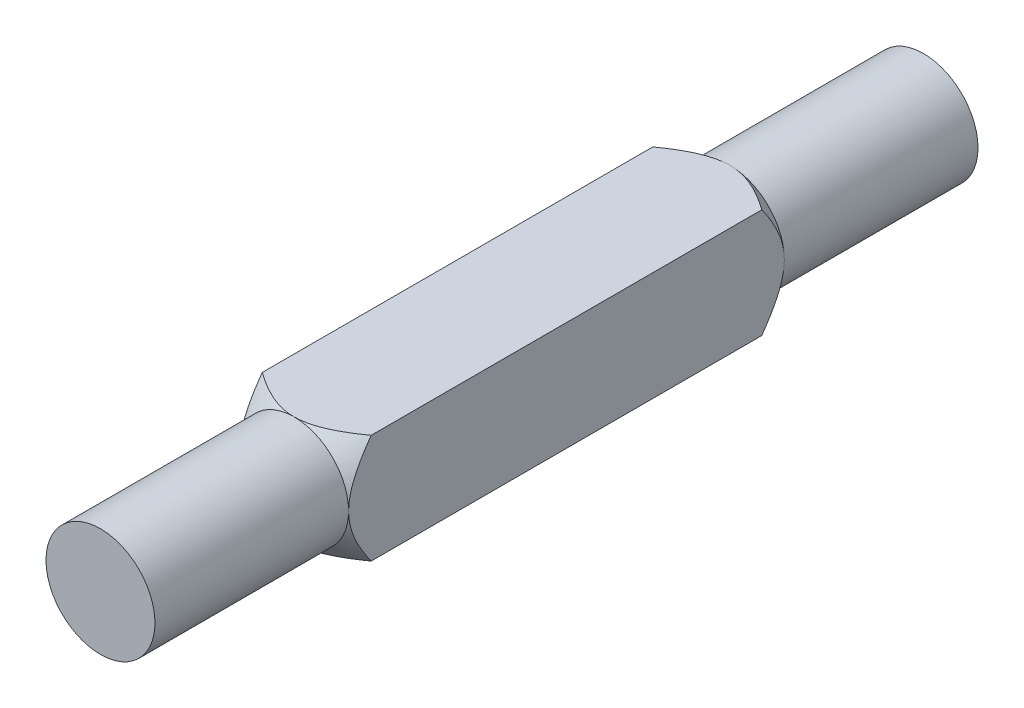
ISO-10303-21;
HEADER;
FILE_DESCRIPTION(('STEP AP214'),'2;1');
FILE_NAME('part.step','',(''),(''),'','','');
FILE_SCHEMA(('AUTOMOTIVE_DESIGN { 1 0 10303 214 1 1 1 1 }'));
ENDSEC;
DATA;
#1=APPLICATION_CONTEXT('core data for automotive mechanical design processes');
#2=APPLICATION_PROTOCOL_DEFINITION('international standard','automotive_design',2000,#1);
#3=PRODUCT_CONTEXT('',#1,'mechanical');
#4=PRODUCT('Part','Part','',(#3));
#5=PRODUCT_RELATED_PRODUCT_CATEGORY('part','',(#4));
#6=PRODUCT_DEFINITION_FORMATION('','',#4);
#7=PRODUCT_DEFINITION_CONTEXT('part definition',#1,'design');
#8=PRODUCT_DEFINITION('design','',#6,#7);
#9=PRODUCT_DEFINITION_SHAPE('','',#8);
#10=(LENGTH_UNIT() NAMED_UNIT(*) SI_UNIT(.MILLI.,.METRE.));
#11=(NAMED_UNIT(*) PLANE_ANGLE_UNIT() SI_UNIT($,.RADIAN.));
#12=(NAMED_UNIT(*) SI_UNIT($,.STERADIAN.) SOLID_ANGLE_UNIT());
#13=UNCERTAINTY_MEASURE_WITH_UNIT(LENGTH_MEASURE(1.E-05),#10,'distance_accuracy_value','');
#14=(GEOMETRIC_REPRESENTATION_CONTEXT(3) GLOBAL_UNCERTAINTY_ASSIGNED_CONTEXT((#13)) GLOBAL_UNIT_ASSIGNED_CONTEXT((#10,
#11,#12)) REPRESENTATION_CONTEXT('',''));
#15=CARTESIAN_POINT('',(0.,0.,0.));
#16=DIRECTION('',(0.,0.,1.));
#17=DIRECTION('',(1.,0.,0.));
#18=AXIS2_PLACEMENT_3D('',#15,#16,#17);
#19=CARTESIAN_POINT('',(-4.5,-4.5,34.));
#20=DIRECTION('',(1.,0.,0.));
#21=DIRECTION('',(0.,0.,-1.));
#22=AXIS2_PLACEMENT_3D('',#19,#20,#21);
#23=PLANE('',#22);
#24=DIRECTION('',(0.,0.,-1.));
#25=VECTOR('',#24,1.);
#26=CARTESIAN_POINT('',(-4.5,4.5,34.));
#27=LINE('',#26,#25);
#28=CARTESIAN_POINT('',(-4.5,4.5,16.1360389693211));
#29=VERTEX_POINT('',#28);
#30=CARTESIAN_POINT('',(-4.5,4.5,-16.1360389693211));
#31=VERTEX_POINT('',#30);
#32=EDGE_CURVE('E131',#29,#31,#27,.T.);
#33=ORIENTED_EDGE('',*,*,#32,.T.);
#34=CARTESIAN_POINT('',(-4.5,-8.68330802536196,-12.7199264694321));
#35=CARTESIAN_POINT('',(-4.5,-8.48158104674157,-12.8990024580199));
#36=CARTESIAN_POINT('',(-4.5,-8.27922210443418,-13.0773734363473));
#37=CARTESIAN_POINT('',(-4.5,-7.87290355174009,-13.4323274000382));
#38=CARTESIAN_POINT('',(-4.5,-7.66894376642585,-13.6089101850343));
#39=CARTESIAN_POINT('',(-4.5,-7.25820360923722,-13.9606644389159));
#40=CARTESIAN_POINT('',(-4.5,-7.05141464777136,-14.1358258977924));
#41=CARTESIAN_POINT('',(-4.5,-6.63550363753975,-14.4833398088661));
#42=CARTESIAN_POINT('',(-4.5,-6.42638170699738,-14.6556924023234));
#43=CARTESIAN_POINT('',(-4.5,-5.99276434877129,-15.0069306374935));
#44=CARTESIAN_POINT('',(-4.5,-5.76809196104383,-15.1855986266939));
#45=CARTESIAN_POINT('',(-4.5,-5.31462777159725,-15.5376133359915));
#46=CARTESIAN_POINT('',(-4.5,-5.08583624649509,-15.7109604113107));
#47=CARTESIAN_POINT('',(-4.5,-4.6233432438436,-16.0501511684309));
#48=CARTESIAN_POINT('',(-4.5,-4.38965142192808,-16.2160078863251));
#49=CARTESIAN_POINT('',(-4.5,-4.03400015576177,-16.4571840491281));
#50=CARTESIAN_POINT('',(-4.5,-3.91461429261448,-16.5362975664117));
#51=CARTESIAN_POINT('',(-4.5,-3.67388199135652,-16.691477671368));
#52=CARTESIAN_POINT('',(-4.5,-3.55253563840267,-16.7675443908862));
#53=CARTESIAN_POINT('',(-4.5,-3.26113140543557,-16.9442017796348));
#54=CARTESIAN_POINT('',(-4.5,-3.09006447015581,-17.043143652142));
#55=CARTESIAN_POINT('',(-4.5,-2.74288321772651,-17.2319657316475));
#56=CARTESIAN_POINT('',(-4.5,-2.56676738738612,-17.3218431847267));
#57=CARTESIAN_POINT('',(-4.5,-2.21034319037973,-17.4889083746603));
#58=CARTESIAN_POINT('',(-4.5,-2.03008217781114,-17.5661959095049));
#59=CARTESIAN_POINT('',(-4.5,-1.66366713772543,-17.7053004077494));
#60=CARTESIAN_POINT('',(-4.5,-1.47751679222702,-17.767126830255));
#61=CARTESIAN_POINT('',(-4.5,-1.15792868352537,-17.8551096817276));
#62=CARTESIAN_POINT('',(-4.5,-1.02590368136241,-17.8863877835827));
#63=CARTESIAN_POINT('',(-4.5,-0.759746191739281,-17.9381805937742));
#64=CARTESIAN_POINT('',(-4.5,-0.625614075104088,-17.9586971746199));
#65=CARTESIAN_POINT('',(-4.5,-0.356412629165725,-17.9878848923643));
#66=CARTESIAN_POINT('',(-4.5,-0.221346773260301,-17.9965876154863));
#67=CARTESIAN_POINT('',(-4.5,0.0490257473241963,-18.0017628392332));
#68=CARTESIAN_POINT('',(-4.5,0.1843324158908,-17.9982351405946));
#69=CARTESIAN_POINT('',(-4.5,0.453784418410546,-17.9791713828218));
#70=CARTESIAN_POINT('',(-4.5,0.587931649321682,-17.9636616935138));
#71=CARTESIAN_POINT('',(-4.5,0.854467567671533,-17.9214869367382));
#72=CARTESIAN_POINT('',(-4.5,0.986855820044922,-17.8948191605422));
#73=CARTESIAN_POINT('',(-4.5,1.24969278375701,-17.8314464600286));
#74=CARTESIAN_POINT('',(-4.5,1.38013256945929,-17.7947049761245));
#75=CARTESIAN_POINT('',(-4.5,1.63824648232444,-17.7126340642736));
#76=CARTESIAN_POINT('',(-4.5,1.76592063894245,-17.6673047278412));
#77=CARTESIAN_POINT('',(-4.5,2.05959775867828,-17.553475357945));
#78=CARTESIAN_POINT('',(-4.5,2.22453500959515,-17.4822379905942));
#79=CARTESIAN_POINT('',(-4.5,2.54978336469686,-17.329822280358));
#80=CARTESIAN_POINT('',(-4.5,2.71009203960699,-17.248638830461));
#81=CARTESIAN_POINT('',(-4.5,3.02684536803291,-17.0783835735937));
#82=CARTESIAN_POINT('',(-4.5,3.18328165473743,-16.9892963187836));
#83=CARTESIAN_POINT('',(-4.5,3.49249529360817,-16.8050801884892));
#84=CARTESIAN_POINT('',(-4.5,3.64527325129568,-16.709952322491));
#85=CARTESIAN_POINT('',(-4.5,3.94991460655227,-16.5135084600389));
#86=CARTESIAN_POINT('',(-4.5,4.10173298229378,-16.4121229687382));
#87=CARTESIAN_POINT('',(-4.5,4.40267413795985,-16.2054321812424));
#88=CARTESIAN_POINT('',(-4.5,4.55179683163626,-16.1001267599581));
#89=CARTESIAN_POINT('',(-4.5,4.847572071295,-15.8864902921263));
#90=CARTESIAN_POINT('',(-4.5,4.99422744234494,-15.7781631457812));
#91=CARTESIAN_POINT('',(-4.5,5.28559307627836,-15.5589414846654));
#92=CARTESIAN_POINT('',(-4.5,5.43030341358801,-15.4480470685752));
#93=CARTESIAN_POINT('',(-4.5,5.75227816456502,-15.1975228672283));
#94=CARTESIAN_POINT('',(-4.5,5.92910326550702,-15.0573290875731));
#95=CARTESIAN_POINT('',(-4.5,6.28066027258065,-14.7743379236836));
#96=CARTESIAN_POINT('',(-4.5,6.45539211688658,-14.6315404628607));
#97=CARTESIAN_POINT('',(-4.5,6.97702291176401,-14.1999709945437));
#98=CARTESIAN_POINT('',(-4.5,7.32131793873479,-13.9080527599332));
#99=CARTESIAN_POINT('',(-4.5,8.00510557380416,-13.31839222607));
#100=CARTESIAN_POINT('',(-4.5,8.3445961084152,-13.0206475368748));
#101=CARTESIAN_POINT('',(-4.5,9.01993957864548,-12.4210524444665));
#102=CARTESIAN_POINT('',(-4.5,9.355792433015,-12.119201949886));
#103=CARTESIAN_POINT('',(-4.5,10.0254208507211,-11.5118619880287));
#104=CARTESIAN_POINT('',(-4.5,10.3591908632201,-11.2063664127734));
#105=CARTESIAN_POINT('',(-4.5,11.0246028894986,-10.5930595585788));
#106=CARTESIAN_POINT('',(-4.5,11.356244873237,-10.2852482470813));
#107=CARTESIAN_POINT('',(-4.5,12.0177625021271,-9.66791121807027));
#108=CARTESIAN_POINT('',(-4.5,12.3476385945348,-9.35838597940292));
#109=CARTESIAN_POINT('',(-4.5,13.0060463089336,-8.7379091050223));
#110=CARTESIAN_POINT('',(-4.5,13.334577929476,-8.42695746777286));
#111=CARTESIAN_POINT('',(-4.5,14.2385387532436,-7.56837718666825));
#112=CARTESIAN_POINT('',(-4.5,14.8128367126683,-7.01955775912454));
#113=CARTESIAN_POINT('',(-4.5,15.9590864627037,-5.9193871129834));
#114=CARTESIAN_POINT('',(-4.5,16.531038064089,-5.36803569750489));
#115=CARTESIAN_POINT('',(-4.5,17.6712329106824,-4.26537922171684));
#116=CARTESIAN_POINT('',(-4.5,18.2394821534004,-3.71408035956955));
#117=CARTESIAN_POINT('',(-4.5,19.374567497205,-2.61012965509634));
#118=CARTESIAN_POINT('',(-4.5,19.941403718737,-2.05747793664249));
#119=CARTESIAN_POINT('',(-4.5,20.5077557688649,-1.50433266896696));
#120=B_SPLINE_CURVE_WITH_KNOTS('',3,(#34,#35,#36,#37,#38,#39,#40,#41,#42,#43,#44,#45,#46,#47,
#48,#49,#50,#51,#52,#53,#54,#55,#56,#57,#58,#59,#60,#61,#62,#63,#64,#65,#66,#67,#68,#69,#70,#71,
#72,#73,#74,#75,#76,#77,#78,#79,#80,#81,#82,#83,#84,#85,#86,#87,#88,#89,#90,#91,#92,#93,#94,#95,
#96,#97,#98,#99,#100,#101,#102,#103,#104,#105,#106,#107,#108,#109,#110,#111,#112,#113,#114,#115,
#116,#117,#118,#119),.UNSPECIFIED.,.F.,.F.,(4,2,2,2,2,2,2,2,2,2,2,2,2,2,2,2,2,2,2,2,2,2,2,2,2,2,
2,2,2,2,2,2,2,2,2,2,2,2,2,2,2,2,4),(0.,0.809238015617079,1.618565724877,2.43155783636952,
3.24450893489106,4.10560871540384,4.96665088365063,5.82613170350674,6.25575364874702,
6.6853569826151,7.27800108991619,7.87082471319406,8.4586926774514,9.04620009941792,
9.45285703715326,9.85944319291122,10.264940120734,10.670443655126,11.0750572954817,
11.4797692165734,11.8859698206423,12.2921660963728,12.8307118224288,13.3695352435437,
13.9094360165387,14.4492467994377,14.9968483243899,15.5444673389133,16.0914095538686,
16.6383307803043,17.3152717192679,17.9922326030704,19.3463039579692,20.7009428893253,
22.0556120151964,23.4130113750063,24.7704298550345,26.1274865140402,27.4845446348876,
29.8676373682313,32.2509186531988,34.6261082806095,37.0010880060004),.UNSPECIFIED.);
#121=CARTESIAN_POINT('',(-4.5,0.,-18.));
#122=VERTEX_POINT('',#121);
#123=EDGE_CURVE('E53',#31,#122,#120,.F.);
#124=ORIENTED_EDGE('',*,*,#123,.T.);
#125=CARTESIAN_POINT('',(-4.5,-4.5,-16.1360389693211));
#126=VERTEX_POINT('',#125);
#127=EDGE_CURVE('E105',#122,#126,#120,.F.);
#128=ORIENTED_EDGE('',*,*,#127,.T.);
#129=DIRECTION('',(0.,0.,-1.));
#130=VECTOR('',#129,1.);
#131=CARTESIAN_POINT('',(-4.5,-4.5,34.));
#132=LINE('',#131,#130);
#133=CARTESIAN_POINT('',(-4.5,-4.5,16.1360389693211));
#134=VERTEX_POINT('',#133);
#135=EDGE_CURVE('E214',#134,#126,#132,.T.);
#136=ORIENTED_EDGE('',*,*,#135,.F.);
#137=CARTESIAN_POINT('',(-4.5,-8.68330802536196,12.7199264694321));
#138=CARTESIAN_POINT('',(-4.5,-8.48158104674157,12.8990024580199));
#139=CARTESIAN_POINT('',(-4.5,-8.27922210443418,13.0773734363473));
#140=CARTESIAN_POINT('',(-4.5,-7.87290355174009,13.4323274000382));
#141=CARTESIAN_POINT('',(-4.5,-7.66894376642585,13.6089101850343));
#142=CARTESIAN_POINT('',(-4.5,-7.25820360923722,13.9606644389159));
#143=CARTESIAN_POINT('',(-4.5,-7.05141464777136,14.1358258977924));
#144=CARTESIAN_POINT('',(-4.5,-6.63550363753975,14.4833398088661));
#145=CARTESIAN_POINT('',(-4.5,-6.42638170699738,14.6556924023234));
#146=CARTESIAN_POINT('',(-4.5,-5.99276434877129,15.0069306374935));
#147=CARTESIAN_POINT('',(-4.5,-5.76809196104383,15.1855986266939));
#148=CARTESIAN_POINT('',(-4.5,-5.31462777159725,15.5376133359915));
#149=CARTESIAN_POINT('',(-4.5,-5.08583624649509,15.7109604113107));
#150=CARTESIAN_POINT('',(-4.5,-4.6233432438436,16.0501511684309));
#151=CARTESIAN_POINT('',(-4.5,-4.38965142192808,16.2160078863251));
#152=CARTESIAN_POINT('',(-4.5,-4.03400015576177,16.4571840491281));
#153=CARTESIAN_POINT('',(-4.5,-3.91461429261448,16.5362975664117));
#154=CARTESIAN_POINT('',(-4.5,-3.67388199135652,16.691477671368));
#155=CARTESIAN_POINT('',(-4.5,-3.55253563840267,16.7675443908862));
#156=CARTESIAN_POINT('',(-4.5,-3.26113140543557,16.9442017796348));
#157=CARTESIAN_POINT('',(-4.5,-3.09006447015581,17.043143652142));
#158=CARTESIAN_POINT('',(-4.5,-2.74288321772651,17.2319657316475));
#159=CARTESIAN_POINT('',(-4.5,-2.56676738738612,17.3218431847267));
#160=CARTESIAN_POINT('',(-4.5,-2.21034319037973,17.4889083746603));
#161=CARTESIAN_POINT('',(-4.5,-2.03008217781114,17.5661959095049));
#162=CARTESIAN_POINT('',(-4.5,-1.66366713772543,17.7053004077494));
#163=CARTESIAN_POINT('',(-4.5,-1.47751679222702,17.767126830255));
#164=CARTESIAN_POINT('',(-4.5,-1.15792868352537,17.8551096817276));
#165=CARTESIAN_POINT('',(-4.5,-1.02590368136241,17.8863877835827));
#166=CARTESIAN_POINT('',(-4.5,-0.759746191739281,17.9381805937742));
#167=CARTESIAN_POINT('',(-4.5,-0.625614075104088,17.9586971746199));
#168=CARTESIAN_POINT('',(-4.5,-0.356412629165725,17.9878848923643));
#169=CARTESIAN_POINT('',(-4.5,-0.221346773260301,17.9965876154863));
#170=CARTESIAN_POINT('',(-4.5,0.0490257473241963,18.0017628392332));
#171=CARTESIAN_POINT('',(-4.5,0.1843324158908,17.9982351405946));
#172=CARTESIAN_POINT('',(-4.5,0.453784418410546,17.9791713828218));
#173=CARTESIAN_POINT('',(-4.5,0.587931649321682,17.9636616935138));
#174=CARTESIAN_POINT('',(-4.5,0.854467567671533,17.9214869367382));
#175=CARTESIAN_POINT('',(-4.5,0.986855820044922,17.8948191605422));
#176=CARTESIAN_POINT('',(-4.5,1.24969278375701,17.8314464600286));
#177=CARTESIAN_POINT('',(-4.5,1.38013256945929,17.7947049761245));
#178=CARTESIAN_POINT('',(-4.5,1.63824648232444,17.7126340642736));
#179=CARTESIAN_POINT('',(-4.5,1.76592063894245,17.6673047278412));
#180=CARTESIAN_POINT('',(-4.5,2.05959775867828,17.553475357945));
#181=CARTESIAN_POINT('',(-4.5,2.22453500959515,17.4822379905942));
#182=CARTESIAN_POINT('',(-4.5,2.54978336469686,17.329822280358));
#183=CARTESIAN_POINT('',(-4.5,2.71009203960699,17.248638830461));
#184=CARTESIAN_POINT('',(-4.5,3.02684536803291,17.0783835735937));
#185=CARTESIAN_POINT('',(-4.5,3.18328165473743,16.9892963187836));
#186=CARTESIAN_POINT('',(-4.5,3.49249529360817,16.8050801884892));
#187=CARTESIAN_POINT('',(-4.5,3.64527325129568,16.709952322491));
#188=CARTESIAN_POINT('',(-4.5,3.94991460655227,16.5135084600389));
#189=CARTESIAN_POINT('',(-4.5,4.10173298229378,16.4121229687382));
#190=CARTESIAN_POINT('',(-4.5,4.40267413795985,16.2054321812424));
#191=CARTESIAN_POINT('',(-4.5,4.55179683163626,16.1001267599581));
#192=CARTESIAN_POINT('',(-4.5,4.847572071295,15.8864902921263));
#193=CARTESIAN_POINT('',(-4.5,4.99422744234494,15.7781631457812));
#194=CARTESIAN_POINT('',(-4.5,5.28559307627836,15.5589414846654));
#195=CARTESIAN_POINT('',(-4.5,5.43030341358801,15.4480470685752));
#196=CARTESIAN_POINT('',(-4.5,5.75227816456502,15.1975228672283));
#197=CARTESIAN_POINT('',(-4.5,5.92910326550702,15.0573290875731));
#198=CARTESIAN_POINT('',(-4.5,6.28066027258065,14.7743379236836));
#199=CARTESIAN_POINT('',(-4.5,6.45539211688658,14.6315404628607));
#200=CARTESIAN_POINT('',(-4.5,6.97702291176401,14.1999709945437));
#201=CARTESIAN_POINT('',(-4.5,7.32131793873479,13.9080527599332));
#202=CARTESIAN_POINT('',(-4.5,8.00510557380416,13.31839222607));
#203=CARTESIAN_POINT('',(-4.5,8.3445961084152,13.0206475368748));
#204=CARTESIAN_POINT('',(-4.5,9.01993957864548,12.4210524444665));
#205=CARTESIAN_POINT('',(-4.5,9.355792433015,12.119201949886));
#206=CARTESIAN_POINT('',(-4.5,10.0254208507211,11.5118619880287));
#207=CARTESIAN_POINT('',(-4.5,10.3591908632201,11.2063664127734));
#208=CARTESIAN_POINT('',(-4.5,11.0246028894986,10.5930595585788));
#209=CARTESIAN_POINT('',(-4.5,11.356244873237,10.2852482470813));
#210=CARTESIAN_POINT('',(-4.5,12.0177625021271,9.66791121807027));
#211=CARTESIAN_POINT('',(-4.5,12.3476385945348,9.35838597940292));
#212=CARTESIAN_POINT('',(-4.5,13.0060463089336,8.7379091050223));
#213=CARTESIAN_POINT('',(-4.5,13.334577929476,8.42695746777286));
#214=CARTESIAN_POINT('',(-4.5,14.2385387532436,7.56837718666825));
#215=CARTESIAN_POINT('',(-4.5,14.8128367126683,7.01955775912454));
#216=CARTESIAN_POINT('',(-4.5,15.9590864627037,5.9193871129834));
#217=CARTESIAN_POINT('',(-4.5,16.531038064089,5.36803569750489));
#218=CARTESIAN_POINT('',(-4.5,17.6712329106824,4.26537922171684));
#219=CARTESIAN_POINT('',(-4.5,18.2394821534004,3.71408035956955));
#220=CARTESIAN_POINT('',(-4.5,19.374567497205,2.61012965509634));
#221=CARTESIAN_POINT('',(-4.5,19.941403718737,2.05747793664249));
#222=CARTESIAN_POINT('',(-4.5,20.5077557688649,1.50433266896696));
#223=B_SPLINE_CURVE_WITH_KNOTS('',3,(#137,#138,#139,#140,#141,#142,#143,#144,#145,#146,#147,
#148,#149,#150,#151,#152,#153,#154,#155,#156,#157,#158,#159,#160,#161,#162,#163,#164,#165,#166,
#167,#168,#169,#170,#171,#172,#173,#174,#175,#176,#177,#178,#179,#180,#181,#182,#183,#184,#185,
#186,#187,#188,#189,#190,#191,#192,#193,#194,#195,#196,#197,#198,#199,#200,#201,#202,#203,#204,
#205,#206,#207,#208,#209,#210,#211,#212,#213,#214,#215,#216,#217,#218,#219,#220,#221,#222),
.UNSPECIFIED.,.F.,.F.,(4,2,2,2,2,2,2,2,2,2,2,2,2,2,2,2,2,2,2,2,2,2,2,2,2,2,2,2,2,2,2,2,2,2,2,2,
2,2,2,2,2,2,4),(0.,0.809238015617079,1.618565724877,2.43155783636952,3.24450893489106,
4.10560871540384,4.96665088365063,5.82613170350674,6.25575364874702,6.6853569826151,
7.27800108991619,7.87082471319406,8.4586926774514,9.04620009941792,9.45285703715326,
9.85944319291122,10.264940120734,10.670443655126,11.0750572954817,11.4797692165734,
11.8859698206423,12.2921660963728,12.8307118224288,13.3695352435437,13.9094360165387,
14.4492467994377,14.9968483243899,15.5444673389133,16.0914095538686,16.6383307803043,
17.3152717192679,17.9922326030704,19.3463039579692,20.7009428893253,22.0556120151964,
23.4130113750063,24.7704298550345,26.1274865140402,27.4845446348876,29.8676373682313,
32.2509186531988,34.6261082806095,37.0010880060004),.UNSPECIFIED.);
#224=CARTESIAN_POINT('',(-4.5,0.,18.));
#225=VERTEX_POINT('',#224);
#226=EDGE_CURVE('E236',#134,#225,#223,.T.);
#227=ORIENTED_EDGE('',*,*,#226,.T.);
#228=EDGE_CURVE('E176',#225,#29,#223,.T.);
#229=ORIENTED_EDGE('',*,*,#228,.T.);
#230=EDGE_LOOP('',(#33,#124,#128,#136,#227,#229));
#231=FACE_BOUND('',#230,.T.);
#232=ADVANCED_FACE('F33',(#231),#23,.F.);
#233=CARTESIAN_POINT('',(-4.5,-4.5,34.));
#234=DIRECTION('',(0.,1.,0.));
#235=DIRECTION('',(0.,0.,1.));
#236=AXIS2_PLACEMENT_3D('',#233,#234,#235);
#237=PLANE('',#236);
#238=ORIENTED_EDGE('',*,*,#135,.T.);
#239=CARTESIAN_POINT('',(-8.68330802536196,-4.5,-12.7199264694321));
#240=CARTESIAN_POINT('',(-8.48158104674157,-4.5,-12.8990024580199));
#241=CARTESIAN_POINT('',(-8.27922210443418,-4.5,-13.0773734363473));
#242=CARTESIAN_POINT('',(-7.87290355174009,-4.5,-13.4323274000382));
#243=CARTESIAN_POINT('',(-7.66894376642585,-4.5,-13.6089101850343));
#244=CARTESIAN_POINT('',(-7.25820360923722,-4.5,-13.9606644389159));
#245=CARTESIAN_POINT('',(-7.05141464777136,-4.5,-14.1358258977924));
#246=CARTESIAN_POINT('',(-6.63550363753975,-4.5,-14.4833398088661));
#247=CARTESIAN_POINT('',(-6.42638170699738,-4.5,-14.6556924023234));
#248=CARTESIAN_POINT('',(-5.99276434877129,-4.5,-15.0069306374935));
#249=CARTESIAN_POINT('',(-5.76809196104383,-4.5,-15.1855986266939));
#250=CARTESIAN_POINT('',(-5.31462777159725,-4.5,-15.5376133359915));
#251=CARTESIAN_POINT('',(-5.08583624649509,-4.5,-15.7109604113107));
#252=CARTESIAN_POINT('',(-4.6233432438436,-4.5,-16.0501511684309));
#253=CARTESIAN_POINT('',(-4.38965142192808,-4.5,-16.2160078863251));
#254=CARTESIAN_POINT('',(-4.03400015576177,-4.5,-16.4571840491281));
#255=CARTESIAN_POINT('',(-3.91461429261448,-4.5,-16.5362975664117));
#256=CARTESIAN_POINT('',(-3.67388199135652,-4.5,-16.691477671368));
#257=CARTESIAN_POINT('',(-3.55253563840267,-4.5,-16.7675443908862));
#258=CARTESIAN_POINT('',(-3.26113140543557,-4.5,-16.9442017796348));
#259=CARTESIAN_POINT('',(-3.09006447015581,-4.5,-17.043143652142));
#260=CARTESIAN_POINT('',(-2.74288321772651,-4.5,-17.2319657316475));
#261=CARTESIAN_POINT('',(-2.56676738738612,-4.5,-17.3218431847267));
#262=CARTESIAN_POINT('',(-2.21034319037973,-4.5,-17.4889083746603));
#263=CARTESIAN_POINT('',(-2.03008217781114,-4.5,-17.5661959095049));
#264=CARTESIAN_POINT('',(-1.66366713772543,-4.5,-17.7053004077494));
#265=CARTESIAN_POINT('',(-1.47751679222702,-4.5,-17.767126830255));
#266=CARTESIAN_POINT('',(-1.15792868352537,-4.5,-17.8551096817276));
#267=CARTESIAN_POINT('',(-1.02590368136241,-4.5,-17.8863877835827));
#268=CARTESIAN_POINT('',(-0.759746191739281,-4.5,-17.9381805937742));
#269=CARTESIAN_POINT('',(-0.625614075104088,-4.5,-17.9586971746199));
#270=CARTESIAN_POINT('',(-0.356412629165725,-4.5,-17.9878848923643));
#271=CARTESIAN_POINT('',(-0.221346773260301,-4.5,-17.9965876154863));
#272=CARTESIAN_POINT('',(0.0490257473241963,-4.5,-18.0017628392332));
#273=CARTESIAN_POINT('',(0.1843324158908,-4.5,-17.9982351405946));
#274=CARTESIAN_POINT('',(0.453784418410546,-4.5,-17.9791713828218));
#275=CARTESIAN_POINT('',(0.587931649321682,-4.5,-17.9636616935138));
#276=CARTESIAN_POINT('',(0.854467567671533,-4.5,-17.9214869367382));
#277=CARTESIAN_POINT('',(0.986855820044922,-4.5,-17.8948191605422));
#278=CARTESIAN_POINT('',(1.24969278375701,-4.5,-17.8314464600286));
#279=CARTESIAN_POINT('',(1.38013256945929,-4.5,-17.7947049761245));
#280=CARTESIAN_POINT('',(1.63824648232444,-4.5,-17.7126340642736));
#281=CARTESIAN_POINT('',(1.76592063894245,-4.5,-17.6673047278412));
#282=CARTESIAN_POINT('',(2.05959775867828,-4.5,-17.553475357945));
#283=CARTESIAN_POINT('',(2.22453500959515,-4.5,-17.4822379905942));
#284=CARTESIAN_POINT('',(2.54978336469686,-4.5,-17.329822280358));
#285=CARTESIAN_POINT('',(2.71009203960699,-4.5,-17.248638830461));
#286=CARTESIAN_POINT('',(3.02684536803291,-4.5,-17.0783835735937));
#287=CARTESIAN_POINT('',(3.18328165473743,-4.5,-16.9892963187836));
#288=CARTESIAN_POINT('',(3.49249529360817,-4.5,-16.8050801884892));
#289=CARTESIAN_POINT('',(3.64527325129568,-4.5,-16.709952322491));
#290=CARTESIAN_POINT('',(3.94991460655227,-4.5,-16.5135084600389));
#291=CARTESIAN_POINT('',(4.10173298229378,-4.5,-16.4121229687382));
#292=CARTESIAN_POINT('',(4.40267413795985,-4.5,-16.2054321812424));
#293=CARTESIAN_POINT('',(4.55179683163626,-4.5,-16.1001267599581));
#294=CARTESIAN_POINT('',(4.847572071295,-4.5,-15.8864902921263));
#295=CARTESIAN_POINT('',(4.99422744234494,-4.5,-15.7781631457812));
#296=CARTESIAN_POINT('',(5.28559307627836,-4.5,-15.5589414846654));
#297=CARTESIAN_POINT('',(5.43030341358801,-4.5,-15.4480470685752));
#298=CARTESIAN_POINT('',(5.75227816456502,-4.5,-15.1975228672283));
#299=CARTESIAN_POINT('',(5.92910326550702,-4.5,-15.0573290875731));
#300=CARTESIAN_POINT('',(6.28066027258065,-4.5,-14.7743379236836));
#301=CARTESIAN_POINT('',(6.45539211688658,-4.5,-14.6315404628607));
#302=CARTESIAN_POINT('',(6.97702291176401,-4.5,-14.1999709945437));
#303=CARTESIAN_POINT('',(7.32131793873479,-4.5,-13.9080527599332));
#304=CARTESIAN_POINT('',(8.00510557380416,-4.5,-13.31839222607));
#305=CARTESIAN_POINT('',(8.3445961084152,-4.5,-13.0206475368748));
#306=CARTESIAN_POINT('',(9.01993957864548,-4.5,-12.4210524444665));
#307=CARTESIAN_POINT('',(9.355792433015,-4.5,-12.119201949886));
#308=CARTESIAN_POINT('',(10.0254208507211,-4.5,-11.5118619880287));
#309=CARTESIAN_POINT('',(10.3591908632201,-4.5,-11.2063664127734));
#310=CARTESIAN_POINT('',(11.0246028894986,-4.5,-10.5930595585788));
#311=CARTESIAN_POINT('',(11.356244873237,-4.5,-10.2852482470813));
#312=CARTESIAN_POINT('',(12.0177625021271,-4.5,-9.66791121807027));
#313=CARTESIAN_POINT('',(12.3476385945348,-4.5,-9.35838597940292));
#314=CARTESIAN_POINT('',(13.0060463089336,-4.5,-8.7379091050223));
#315=CARTESIAN_POINT('',(13.334577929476,-4.5,-8.42695746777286));
#316=CARTESIAN_POINT('',(14.2385387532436,-4.5,-7.56837718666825));
#317=CARTESIAN_POINT('',(14.8128367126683,-4.5,-7.01955775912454));
#318=CARTESIAN_POINT('',(15.9590864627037,-4.5,-5.9193871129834));
#319=CARTESIAN_POINT('',(16.531038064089,-4.5,-5.36803569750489));
#320=CARTESIAN_POINT('',(17.6712329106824,-4.5,-4.26537922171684));
#321=CARTESIAN_POINT('',(18.2394821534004,-4.5,-3.71408035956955));
#322=CARTESIAN_POINT('',(19.374567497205,-4.5,-2.61012965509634));
#323=CARTESIAN_POINT('',(19.941403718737,-4.5,-2.05747793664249));
#324=CARTESIAN_POINT('',(20.5077557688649,-4.5,-1.50433266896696));
#325=B_SPLINE_CURVE_WITH_KNOTS('',3,(#239,#240,#241,#242,#243,#244,#245,#246,#247,#248,#249,
#250,#251,#252,#253,#254,#255,#256,#257,#258,#259,#260,#261,#262,#263,#264,#265,#266,#267,#268,
#269,#270,#271,#272,#273,#274,#275,#276,#277,#278,#279,#280,#281,#282,#283,#284,#285,#286,#287,
#288,#289,#290,#291,#292,#293,#294,#295,#296,#297,#298,#299,#300,#301,#302,#303,#304,#305,#306,
#307,#308,#309,#310,#311,#312,#313,#314,#315,#316,#317,#318,#319,#320,#321,#322,#323,#324),
.UNSPECIFIED.,.F.,.F.,(4,2,2,2,2,2,2,2,2,2,2,2,2,2,2,2,2,2,2,2,2,2,2,2,2,2,2,2,2,2,2,2,2,2,2,2,
2,2,2,2,2,2,4),(0.,0.809238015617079,1.618565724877,2.43155783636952,3.24450893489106,
4.10560871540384,4.96665088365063,5.82613170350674,6.25575364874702,6.6853569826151,
7.27800108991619,7.87082471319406,8.4586926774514,9.04620009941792,9.45285703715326,
9.85944319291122,10.264940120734,10.670443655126,11.0750572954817,11.4797692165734,
11.8859698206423,12.2921660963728,12.8307118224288,13.3695352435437,13.9094360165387,
14.4492467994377,14.9968483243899,15.5444673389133,16.0914095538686,16.6383307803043,
17.3152717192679,17.9922326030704,19.3463039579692,20.7009428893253,22.0556120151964,
23.4130113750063,24.7704298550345,26.1274865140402,27.4845446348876,29.8676373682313,
32.2509186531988,34.6261082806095,37.0010880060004),.UNSPECIFIED.);
#326=CARTESIAN_POINT('',(0.,-4.5,-18.));
#327=VERTEX_POINT('',#326);
#328=EDGE_CURVE('E111',#126,#327,#325,.T.);
#329=ORIENTED_EDGE('',*,*,#328,.T.);
#330=CARTESIAN_POINT('',(4.5,-4.5,-16.1360389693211));
#331=VERTEX_POINT('',#330);
#332=EDGE_CURVE('E141',#327,#331,#325,.T.);
#333=ORIENTED_EDGE('',*,*,#332,.T.);
#334=DIRECTION('',(0.,0.,-1.));
#335=VECTOR('',#334,1.);
#336=CARTESIAN_POINT('',(4.5,-4.5,34.));
#337=LINE('',#336,#335);
#338=CARTESIAN_POINT('',(4.5,-4.5,16.1360389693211));
#339=VERTEX_POINT('',#338);
#340=EDGE_CURVE('E211',#339,#331,#337,.T.);
#341=ORIENTED_EDGE('',*,*,#340,.F.);
#342=CARTESIAN_POINT('',(-8.68330802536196,-4.5,12.7199264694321));
#343=CARTESIAN_POINT('',(-8.48158104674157,-4.5,12.8990024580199));
#344=CARTESIAN_POINT('',(-8.27922210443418,-4.5,13.0773734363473));
#345=CARTESIAN_POINT('',(-7.87290355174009,-4.5,13.4323274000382));
#346=CARTESIAN_POINT('',(-7.66894376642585,-4.5,13.6089101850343));
#347=CARTESIAN_POINT('',(-7.25820360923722,-4.5,13.9606644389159));
#348=CARTESIAN_POINT('',(-7.05141464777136,-4.5,14.1358258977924));
#349=CARTESIAN_POINT('',(-6.63550363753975,-4.5,14.4833398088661));
#350=CARTESIAN_POINT('',(-6.42638170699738,-4.5,14.6556924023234));
#351=CARTESIAN_POINT('',(-5.99276434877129,-4.5,15.0069306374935));
#352=CARTESIAN_POINT('',(-5.76809196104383,-4.5,15.1855986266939));
#353=CARTESIAN_POINT('',(-5.31462777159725,-4.5,15.5376133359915));
#354=CARTESIAN_POINT('',(-5.08583624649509,-4.5,15.7109604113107));
#355=CARTESIAN_POINT('',(-4.6233432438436,-4.5,16.0501511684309));
#356=CARTESIAN_POINT('',(-4.38965142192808,-4.5,16.2160078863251));
#357=CARTESIAN_POINT('',(-4.03400015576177,-4.5,16.4571840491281));
#358=CARTESIAN_POINT('',(-3.91461429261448,-4.5,16.5362975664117));
#359=CARTESIAN_POINT('',(-3.67388199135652,-4.5,16.691477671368));
#360=CARTESIAN_POINT('',(-3.55253563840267,-4.5,16.7675443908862));
#361=CARTESIAN_POINT('',(-3.26113140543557,-4.5,16.9442017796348));
#362=CARTESIAN_POINT('',(-3.09006447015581,-4.5,17.043143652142));
#363=CARTESIAN_POINT('',(-2.74288321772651,-4.5,17.2319657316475));
#364=CARTESIAN_POINT('',(-2.56676738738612,-4.5,17.3218431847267));
#365=CARTESIAN_POINT('',(-2.21034319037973,-4.5,17.4889083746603));
#366=CARTESIAN_POINT('',(-2.03008217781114,-4.5,17.5661959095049));
#367=CARTESIAN_POINT('',(-1.66366713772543,-4.5,17.7053004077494));
#368=CARTESIAN_POINT('',(-1.47751679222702,-4.5,17.767126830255));
#369=CARTESIAN_POINT('',(-1.15792868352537,-4.5,17.8551096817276));
#370=CARTESIAN_POINT('',(-1.02590368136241,-4.5,17.8863877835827));
#371=CARTESIAN_POINT('',(-0.759746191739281,-4.5,17.9381805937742));
#372=CARTESIAN_POINT('',(-0.625614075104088,-4.5,17.9586971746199));
#373=CARTESIAN_POINT('',(-0.356412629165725,-4.5,17.9878848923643));
#374=CARTESIAN_POINT('',(-0.221346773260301,-4.5,17.9965876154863));
#375=CARTESIAN_POINT('',(0.0490257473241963,-4.5,18.0017628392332));
#376=CARTESIAN_POINT('',(0.1843324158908,-4.5,17.9982351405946));
#377=CARTESIAN_POINT('',(0.453784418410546,-4.5,17.9791713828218));
#378=CARTESIAN_POINT('',(0.587931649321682,-4.5,17.9636616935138));
#379=CARTESIAN_POINT('',(0.854467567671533,-4.5,17.9214869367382));
#380=CARTESIAN_POINT('',(0.986855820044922,-4.5,17.8948191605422));
#381=CARTESIAN_POINT('',(1.24969278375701,-4.5,17.8314464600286));
#382=CARTESIAN_POINT('',(1.38013256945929,-4.5,17.7947049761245));
#383=CARTESIAN_POINT('',(1.63824648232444,-4.5,17.7126340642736));
#384=CARTESIAN_POINT('',(1.76592063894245,-4.5,17.6673047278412));
#385=CARTESIAN_POINT('',(2.05959775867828,-4.5,17.553475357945));
#386=CARTESIAN_POINT('',(2.22453500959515,-4.5,17.4822379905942));
#387=CARTESIAN_POINT('',(2.54978336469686,-4.5,17.329822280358));
#388=CARTESIAN_POINT('',(2.71009203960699,-4.5,17.248638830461));
#389=CARTESIAN_POINT('',(3.02684536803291,-4.5,17.0783835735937));
#390=CARTESIAN_POINT('',(3.18328165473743,-4.5,16.9892963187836));
#391=CARTESIAN_POINT('',(3.49249529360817,-4.5,16.8050801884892));
#392=CARTESIAN_POINT('',(3.64527325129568,-4.5,16.709952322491));
#393=CARTESIAN_POINT('',(3.94991460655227,-4.5,16.5135084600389));
#394=CARTESIAN_POINT('',(4.10173298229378,-4.5,16.4121229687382));
#395=CARTESIAN_POINT('',(4.40267413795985,-4.5,16.2054321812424));
#396=CARTESIAN_POINT('',(4.55179683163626,-4.5,16.1001267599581));
#397=CARTESIAN_POINT('',(4.847572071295,-4.5,15.8864902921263));
#398=CARTESIAN_POINT('',(4.99422744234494,-4.5,15.7781631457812));
#399=CARTESIAN_POINT('',(5.28559307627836,-4.5,15.5589414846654));
#400=CARTESIAN_POINT('',(5.43030341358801,-4.5,15.4480470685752));
#401=CARTESIAN_POINT('',(5.75227816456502,-4.5,15.1975228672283));
#402=CARTESIAN_POINT('',(5.92910326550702,-4.5,15.0573290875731));
#403=CARTESIAN_POINT('',(6.28066027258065,-4.5,14.7743379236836));
#404=CARTESIAN_POINT('',(6.45539211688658,-4.5,14.6315404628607));
#405=CARTESIAN_POINT('',(6.97702291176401,-4.5,14.1999709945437));
#406=CARTESIAN_POINT('',(7.32131793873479,-4.5,13.9080527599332));
#407=CARTESIAN_POINT('',(8.00510557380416,-4.5,13.31839222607));
#408=CARTESIAN_POINT('',(8.3445961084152,-4.5,13.0206475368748));
#409=CARTESIAN_POINT('',(9.01993957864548,-4.5,12.4210524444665));
#410=CARTESIAN_POINT('',(9.355792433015,-4.5,12.119201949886));
#411=CARTESIAN_POINT('',(10.0254208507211,-4.5,11.5118619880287));
#412=CARTESIAN_POINT('',(10.3591908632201,-4.5,11.2063664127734));
#413=CARTESIAN_POINT('',(11.0246028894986,-4.5,10.5930595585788));
#414=CARTESIAN_POINT('',(11.356244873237,-4.5,10.2852482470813));
#415=CARTESIAN_POINT('',(12.0177625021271,-4.5,9.66791121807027));
#416=CARTESIAN_POINT('',(12.3476385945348,-4.5,9.35838597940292));
#417=CARTESIAN_POINT('',(13.0060463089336,-4.5,8.7379091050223));
#418=CARTESIAN_POINT('',(13.334577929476,-4.5,8.42695746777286));
#419=CARTESIAN_POINT('',(14.2385387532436,-4.5,7.56837718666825));
#420=CARTESIAN_POINT('',(14.8128367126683,-4.5,7.01955775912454));
#421=CARTESIAN_POINT('',(15.9590864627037,-4.5,5.9193871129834));
#422=CARTESIAN_POINT('',(16.531038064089,-4.5,5.36803569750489));
#423=CARTESIAN_POINT('',(17.6712329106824,-4.5,4.26537922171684));
#424=CARTESIAN_POINT('',(18.2394821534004,-4.5,3.71408035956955));
#425=CARTESIAN_POINT('',(19.374567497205,-4.5,2.61012965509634));
#426=CARTESIAN_POINT('',(19.941403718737,-4.5,2.05747793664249));
#427=CARTESIAN_POINT('',(20.5077557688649,-4.5,1.50433266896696));
#428=B_SPLINE_CURVE_WITH_KNOTS('',3,(#342,#343,#344,#345,#346,#347,#348,#349,#350,#351,#352,
#353,#354,#355,#356,#357,#358,#359,#360,#361,#362,#363,#364,#365,#366,#367,#368,#369,#370,#371,
#372,#373,#374,#375,#376,#377,#378,#379,#380,#381,#382,#383,#384,#385,#386,#387,#388,#389,#390,
#391,#392,#393,#394,#395,#396,#397,#398,#399,#400,#401,#402,#403,#404,#405,#406,#407,#408,#409,
#410,#411,#412,#413,#414,#415,#416,#417,#418,#419,#420,#421,#422,#423,#424,#425,#426,#427),
.UNSPECIFIED.,.F.,.F.,(4,2,2,2,2,2,2,2,2,2,2,2,2,2,2,2,2,2,2,2,2,2,2,2,2,2,2,2,2,2,2,2,2,2,2,2,
2,2,2,2,2,2,4),(0.,0.809238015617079,1.618565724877,2.43155783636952,3.24450893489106,
4.10560871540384,4.96665088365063,5.82613170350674,6.25575364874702,6.6853569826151,
7.27800108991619,7.87082471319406,8.4586926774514,9.04620009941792,9.45285703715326,
9.85944319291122,10.264940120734,10.670443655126,11.0750572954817,11.4797692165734,
11.8859698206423,12.2921660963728,12.8307118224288,13.3695352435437,13.9094360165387,
14.4492467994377,14.9968483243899,15.5444673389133,16.0914095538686,16.6383307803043,
17.3152717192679,17.9922326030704,19.3463039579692,20.7009428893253,22.0556120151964,
23.4130113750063,24.7704298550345,26.1274865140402,27.4845446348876,29.8676373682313,
32.2509186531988,34.6261082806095,37.0010880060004),.UNSPECIFIED.);
#429=CARTESIAN_POINT('',(0.,-4.5,18.));
#430=VERTEX_POINT('',#429);
#431=EDGE_CURVE('E206',#339,#430,#428,.F.);
#432=ORIENTED_EDGE('',*,*,#431,.T.);
#433=EDGE_CURVE('E200',#430,#134,#428,.F.);
#434=ORIENTED_EDGE('',*,*,#433,.T.);
#435=EDGE_LOOP('',(#238,#329,#333,#341,#432,#434));
#436=FACE_BOUND('',#435,.T.);
#437=ADVANCED_FACE('F166',(#436),#237,.F.);
#438=CARTESIAN_POINT('',(4.5,-4.5,34.));
#439=DIRECTION('',(-1.,0.,0.));
#440=DIRECTION('',(0.,0.,1.));
#441=AXIS2_PLACEMENT_3D('',#438,#439,#440);
#442=PLANE('',#441);
#443=ORIENTED_EDGE('',*,*,#340,.T.);
#444=CARTESIAN_POINT('',(4.5,-8.68330802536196,-12.7199264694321));
#445=CARTESIAN_POINT('',(4.5,-8.48158104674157,-12.8990024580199));
#446=CARTESIAN_POINT('',(4.5,-8.27922210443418,-13.0773734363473));
#447=CARTESIAN_POINT('',(4.5,-7.87290355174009,-13.4323274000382));
#448=CARTESIAN_POINT('',(4.5,-7.66894376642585,-13.6089101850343));
#449=CARTESIAN_POINT('',(4.5,-7.25820360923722,-13.9606644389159));
#450=CARTESIAN_POINT('',(4.5,-7.05141464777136,-14.1358258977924));
#451=CARTESIAN_POINT('',(4.5,-6.63550363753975,-14.4833398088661));
#452=CARTESIAN_POINT('',(4.5,-6.42638170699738,-14.6556924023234));
#453=CARTESIAN_POINT('',(4.5,-5.99276434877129,-15.0069306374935));
#454=CARTESIAN_POINT('',(4.5,-5.76809196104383,-15.1855986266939));
#455=CARTESIAN_POINT('',(4.5,-5.31462777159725,-15.5376133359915));
#456=CARTESIAN_POINT('',(4.5,-5.08583624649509,-15.7109604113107));
#457=CARTESIAN_POINT('',(4.5,-4.6233432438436,-16.0501511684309));
#458=CARTESIAN_POINT('',(4.5,-4.38965142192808,-16.2160078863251));
#459=CARTESIAN_POINT('',(4.5,-4.03400015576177,-16.4571840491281));
#460=CARTESIAN_POINT('',(4.5,-3.91461429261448,-16.5362975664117));
#461=CARTESIAN_POINT('',(4.5,-3.67388199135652,-16.691477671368));
#462=CARTESIAN_POINT('',(4.5,-3.55253563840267,-16.7675443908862));
#463=CARTESIAN_POINT('',(4.5,-3.26113140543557,-16.9442017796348));
#464=CARTESIAN_POINT('',(4.5,-3.09006447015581,-17.043143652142));
#465=CARTESIAN_POINT('',(4.5,-2.74288321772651,-17.2319657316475));
#466=CARTESIAN_POINT('',(4.5,-2.56676738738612,-17.3218431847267));
#467=CARTESIAN_POINT('',(4.5,-2.21034319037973,-17.4889083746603));
#468=CARTESIAN_POINT('',(4.5,-2.03008217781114,-17.5661959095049));
#469=CARTESIAN_POINT('',(4.5,-1.66366713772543,-17.7053004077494));
#470=CARTESIAN_POINT('',(4.5,-1.47751679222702,-17.767126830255));
#471=CARTESIAN_POINT('',(4.5,-1.15792868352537,-17.8551096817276));
#472=CARTESIAN_POINT('',(4.5,-1.02590368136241,-17.8863877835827));
#473=CARTESIAN_POINT('',(4.5,-0.759746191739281,-17.9381805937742));
#474=CARTESIAN_POINT('',(4.5,-0.625614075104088,-17.9586971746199));
#475=CARTESIAN_POINT('',(4.5,-0.356412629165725,-17.9878848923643));
#476=CARTESIAN_POINT('',(4.5,-0.221346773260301,-17.9965876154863));
#477=CARTESIAN_POINT('',(4.5,0.0490257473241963,-18.0017628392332));
#478=CARTESIAN_POINT('',(4.5,0.1843324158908,-17.9982351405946));
#479=CARTESIAN_POINT('',(4.5,0.453784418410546,-17.9791713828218));
#480=CARTESIAN_POINT('',(4.5,0.587931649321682,-17.9636616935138));
#481=CARTESIAN_POINT('',(4.5,0.854467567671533,-17.9214869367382));
#482=CARTESIAN_POINT('',(4.5,0.986855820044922,-17.8948191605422));
#483=CARTESIAN_POINT('',(4.5,1.24969278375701,-17.8314464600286));
#484=CARTESIAN_POINT('',(4.5,1.38013256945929,-17.7947049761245));
#485=CARTESIAN_POINT('',(4.5,1.63824648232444,-17.7126340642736));
#486=CARTESIAN_POINT('',(4.5,1.76592063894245,-17.6673047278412));
#487=CARTESIAN_POINT('',(4.5,2.05959775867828,-17.553475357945));
#488=CARTESIAN_POINT('',(4.5,2.22453500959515,-17.4822379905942));
#489=CARTESIAN_POINT('',(4.5,2.54978336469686,-17.329822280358));
#490=CARTESIAN_POINT('',(4.5,2.71009203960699,-17.248638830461));
#491=CARTESIAN_POINT('',(4.5,3.02684536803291,-17.0783835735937));
#492=CARTESIAN_POINT('',(4.5,3.18328165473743,-16.9892963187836));
#493=CARTESIAN_POINT('',(4.5,3.49249529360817,-16.8050801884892));
#494=CARTESIAN_POINT('',(4.5,3.64527325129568,-16.709952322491));
#495=CARTESIAN_POINT('',(4.5,3.94991460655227,-16.5135084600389));
#496=CARTESIAN_POINT('',(4.5,4.10173298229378,-16.4121229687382));
#497=CARTESIAN_POINT('',(4.5,4.40267413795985,-16.2054321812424));
#498=CARTESIAN_POINT('',(4.5,4.55179683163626,-16.1001267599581));
#499=CARTESIAN_POINT('',(4.5,4.847572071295,-15.8864902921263));
#500=CARTESIAN_POINT('',(4.5,4.99422744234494,-15.7781631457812));
#501=CARTESIAN_POINT('',(4.5,5.28559307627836,-15.5589414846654));
#502=CARTESIAN_POINT('',(4.5,5.43030341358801,-15.4480470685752));
#503=CARTESIAN_POINT('',(4.5,5.75227816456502,-15.1975228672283));
#504=CARTESIAN_POINT('',(4.5,5.92910326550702,-15.0573290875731));
#505=CARTESIAN_POINT('',(4.5,6.28066027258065,-14.7743379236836));
#506=CARTESIAN_POINT('',(4.5,6.45539211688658,-14.6315404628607));
#507=CARTESIAN_POINT('',(4.5,6.97702291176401,-14.1999709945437));
#508=CARTESIAN_POINT('',(4.5,7.32131793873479,-13.9080527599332));
#509=CARTESIAN_POINT('',(4.5,8.00510557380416,-13.31839222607));
#510=CARTESIAN_POINT('',(4.5,8.3445961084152,-13.0206475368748));
#511=CARTESIAN_POINT('',(4.5,9.01993957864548,-12.4210524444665));
#512=CARTESIAN_POINT('',(4.5,9.355792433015,-12.119201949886));
#513=CARTESIAN_POINT('',(4.5,10.0254208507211,-11.5118619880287));
#514=CARTESIAN_POINT('',(4.5,10.3591908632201,-11.2063664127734));
#515=CARTESIAN_POINT('',(4.5,11.0246028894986,-10.5930595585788));
#516=CARTESIAN_POINT('',(4.5,11.356244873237,-10.2852482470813));
#517=CARTESIAN_POINT('',(4.5,12.0177625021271,-9.66791121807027));
#518=CARTESIAN_POINT('',(4.5,12.3476385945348,-9.35838597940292));
#519=CARTESIAN_POINT('',(4.5,13.0060463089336,-8.7379091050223));
#520=CARTESIAN_POINT('',(4.5,13.334577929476,-8.42695746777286));
#521=CARTESIAN_POINT('',(4.5,14.2385387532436,-7.56837718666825));
#522=CARTESIAN_POINT('',(4.5,14.8128367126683,-7.01955775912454));
#523=CARTESIAN_POINT('',(4.5,15.9590864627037,-5.9193871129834));
#524=CARTESIAN_POINT('',(4.5,16.531038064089,-5.36803569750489));
#525=CARTESIAN_POINT('',(4.5,17.6712329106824,-4.26537922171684));
#526=CARTESIAN_POINT('',(4.5,18.2394821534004,-3.71408035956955));
#527=CARTESIAN_POINT('',(4.5,19.374567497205,-2.61012965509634));
#528=CARTESIAN_POINT('',(4.5,19.941403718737,-2.05747793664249));
#529=CARTESIAN_POINT('',(4.5,20.5077557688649,-1.50433266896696));
#530=B_SPLINE_CURVE_WITH_KNOTS('',3,(#444,#445,#446,#447,#448,#449,#450,#451,#452,#453,#454,
#455,#456,#457,#458,#459,#460,#461,#462,#463,#464,#465,#466,#467,#468,#469,#470,#471,#472,#473,
#474,#475,#476,#477,#478,#479,#480,#481,#482,#483,#484,#485,#486,#487,#488,#489,#490,#491,#492,
#493,#494,#495,#496,#497,#498,#499,#500,#501,#502,#503,#504,#505,#506,#507,#508,#509,#510,#511,
#512,#513,#514,#515,#516,#517,#518,#519,#520,#521,#522,#523,#524,#525,#526,#527,#528,#529),
.UNSPECIFIED.,.F.,.F.,(4,2,2,2,2,2,2,2,2,2,2,2,2,2,2,2,2,2,2,2,2,2,2,2,2,2,2,2,2,2,2,2,2,2,2,2,
2,2,2,2,2,2,4),(0.,0.809238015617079,1.618565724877,2.43155783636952,3.24450893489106,
4.10560871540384,4.96665088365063,5.82613170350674,6.25575364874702,6.6853569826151,
7.27800108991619,7.87082471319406,8.4586926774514,9.04620009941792,9.45285703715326,
9.85944319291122,10.264940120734,10.670443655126,11.0750572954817,11.4797692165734,
11.8859698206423,12.2921660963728,12.8307118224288,13.3695352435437,13.9094360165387,
14.4492467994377,14.9968483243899,15.5444673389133,16.0914095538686,16.6383307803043,
17.3152717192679,17.9922326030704,19.3463039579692,20.7009428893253,22.0556120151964,
23.4130113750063,24.7704298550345,26.1274865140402,27.4845446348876,29.8676373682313,
32.2509186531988,34.6261082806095,37.0010880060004),.UNSPECIFIED.);
#531=CARTESIAN_POINT('',(4.5,0.,-18.));
#532=VERTEX_POINT('',#531);
#533=EDGE_CURVE('E161',#331,#532,#530,.T.);
#534=ORIENTED_EDGE('',*,*,#533,.T.);
#535=CARTESIAN_POINT('',(4.5,4.5,-16.1360389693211));
#536=VERTEX_POINT('',#535);
#537=EDGE_CURVE('E126',#532,#536,#530,.T.);
#538=ORIENTED_EDGE('',*,*,#537,.T.);
#539=DIRECTION('',(0.,0.,-1.));
#540=VECTOR('',#539,1.);
#541=CARTESIAN_POINT('',(4.5,4.5,34.));
#542=LINE('',#541,#540);
#543=CARTESIAN_POINT('',(4.5,4.5,16.1360389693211));
#544=VERTEX_POINT('',#543);
#545=EDGE_CURVE('E208',#544,#536,#542,.T.);
#546=ORIENTED_EDGE('',*,*,#545,.F.);
#547=CARTESIAN_POINT('',(4.5,-8.68330802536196,12.7199264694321));
#548=CARTESIAN_POINT('',(4.5,-8.48158104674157,12.8990024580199));
#549=CARTESIAN_POINT('',(4.5,-8.27922210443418,13.0773734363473));
#550=CARTESIAN_POINT('',(4.5,-7.87290355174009,13.4323274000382));
#551=CARTESIAN_POINT('',(4.5,-7.66894376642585,13.6089101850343));
#552=CARTESIAN_POINT('',(4.5,-7.25820360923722,13.9606644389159));
#553=CARTESIAN_POINT('',(4.5,-7.05141464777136,14.1358258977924));
#554=CARTESIAN_POINT('',(4.5,-6.63550363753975,14.4833398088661));
#555=CARTESIAN_POINT('',(4.5,-6.42638170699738,14.6556924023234));
#556=CARTESIAN_POINT('',(4.5,-5.99276434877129,15.0069306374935));
#557=CARTESIAN_POINT('',(4.5,-5.76809196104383,15.1855986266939));
#558=CARTESIAN_POINT('',(4.5,-5.31462777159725,15.5376133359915));
#559=CARTESIAN_POINT('',(4.5,-5.08583624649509,15.7109604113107));
#560=CARTESIAN_POINT('',(4.5,-4.6233432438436,16.0501511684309));
#561=CARTESIAN_POINT('',(4.5,-4.38965142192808,16.2160078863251));
#562=CARTESIAN_POINT('',(4.5,-4.03400015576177,16.4571840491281));
#563=CARTESIAN_POINT('',(4.5,-3.91461429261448,16.5362975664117));
#564=CARTESIAN_POINT('',(4.5,-3.67388199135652,16.691477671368));
#565=CARTESIAN_POINT('',(4.5,-3.55253563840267,16.7675443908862));
#566=CARTESIAN_POINT('',(4.5,-3.26113140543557,16.9442017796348));
#567=CARTESIAN_POINT('',(4.5,-3.09006447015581,17.043143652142));
#568=CARTESIAN_POINT('',(4.5,-2.74288321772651,17.2319657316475));
#569=CARTESIAN_POINT('',(4.5,-2.56676738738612,17.3218431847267));
#570=CARTESIAN_POINT('',(4.5,-2.21034319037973,17.4889083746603));
#571=CARTESIAN_POINT('',(4.5,-2.03008217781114,17.5661959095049));
#572=CARTESIAN_POINT('',(4.5,-1.66366713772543,17.7053004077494));
#573=CARTESIAN_POINT('',(4.5,-1.47751679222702,17.767126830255));
#574=CARTESIAN_POINT('',(4.5,-1.15792868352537,17.8551096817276));
#575=CARTESIAN_POINT('',(4.5,-1.02590368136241,17.8863877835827));
#576=CARTESIAN_POINT('',(4.5,-0.759746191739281,17.9381805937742));
#577=CARTESIAN_POINT('',(4.5,-0.625614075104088,17.9586971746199));
#578=CARTESIAN_POINT('',(4.5,-0.356412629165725,17.9878848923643));
#579=CARTESIAN_POINT('',(4.5,-0.221346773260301,17.9965876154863));
#580=CARTESIAN_POINT('',(4.5,0.0490257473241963,18.0017628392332));
#581=CARTESIAN_POINT('',(4.5,0.1843324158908,17.9982351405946));
#582=CARTESIAN_POINT('',(4.5,0.453784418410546,17.9791713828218));
#583=CARTESIAN_POINT('',(4.5,0.587931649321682,17.9636616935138));
#584=CARTESIAN_POINT('',(4.5,0.854467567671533,17.9214869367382));
#585=CARTESIAN_POINT('',(4.5,0.986855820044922,17.8948191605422));
#586=CARTESIAN_POINT('',(4.5,1.24969278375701,17.8314464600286));
#587=CARTESIAN_POINT('',(4.5,1.38013256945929,17.7947049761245));
#588=CARTESIAN_POINT('',(4.5,1.63824648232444,17.7126340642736));
#589=CARTESIAN_POINT('',(4.5,1.76592063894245,17.6673047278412));
#590=CARTESIAN_POINT('',(4.5,2.05959775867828,17.553475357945));
#591=CARTESIAN_POINT('',(4.5,2.22453500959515,17.4822379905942));
#592=CARTESIAN_POINT('',(4.5,2.54978336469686,17.329822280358));
#593=CARTESIAN_POINT('',(4.5,2.71009203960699,17.248638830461));
#594=CARTESIAN_POINT('',(4.5,3.02684536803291,17.0783835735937));
#595=CARTESIAN_POINT('',(4.5,3.18328165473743,16.9892963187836));
#596=CARTESIAN_POINT('',(4.5,3.49249529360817,16.8050801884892));
#597=CARTESIAN_POINT('',(4.5,3.64527325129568,16.709952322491));
#598=CARTESIAN_POINT('',(4.5,3.94991460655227,16.5135084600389));
#599=CARTESIAN_POINT('',(4.5,4.10173298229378,16.4121229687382));
#600=CARTESIAN_POINT('',(4.5,4.40267413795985,16.2054321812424));
#601=CARTESIAN_POINT('',(4.5,4.55179683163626,16.1001267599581));
#602=CARTESIAN_POINT('',(4.5,4.847572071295,15.8864902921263));
#603=CARTESIAN_POINT('',(4.5,4.99422744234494,15.7781631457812));
#604=CARTESIAN_POINT('',(4.5,5.28559307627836,15.5589414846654));
#605=CARTESIAN_POINT('',(4.5,5.43030341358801,15.4480470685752));
#606=CARTESIAN_POINT('',(4.5,5.75227816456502,15.1975228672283));
#607=CARTESIAN_POINT('',(4.5,5.92910326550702,15.0573290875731));
#608=CARTESIAN_POINT('',(4.5,6.28066027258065,14.7743379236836));
#609=CARTESIAN_POINT('',(4.5,6.45539211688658,14.6315404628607));
#610=CARTESIAN_POINT('',(4.5,6.97702291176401,14.1999709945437));
#611=CARTESIAN_POINT('',(4.5,7.32131793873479,13.9080527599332));
#612=CARTESIAN_POINT('',(4.5,8.00510557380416,13.31839222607));
#613=CARTESIAN_POINT('',(4.5,8.3445961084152,13.0206475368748));
#614=CARTESIAN_POINT('',(4.5,9.01993957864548,12.4210524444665));
#615=CARTESIAN_POINT('',(4.5,9.355792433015,12.119201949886));
#616=CARTESIAN_POINT('',(4.5,10.0254208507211,11.5118619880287));
#617=CARTESIAN_POINT('',(4.5,10.3591908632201,11.2063664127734));
#618=CARTESIAN_POINT('',(4.5,11.0246028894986,10.5930595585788));
#619=CARTESIAN_POINT('',(4.5,11.356244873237,10.2852482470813));
#620=CARTESIAN_POINT('',(4.5,12.0177625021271,9.66791121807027));
#621=CARTESIAN_POINT('',(4.5,12.3476385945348,9.35838597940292));
#622=CARTESIAN_POINT('',(4.5,13.0060463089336,8.7379091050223));
#623=CARTESIAN_POINT('',(4.5,13.334577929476,8.42695746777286));
#624=CARTESIAN_POINT('',(4.5,14.2385387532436,7.56837718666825));
#625=CARTESIAN_POINT('',(4.5,14.8128367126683,7.01955775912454));
#626=CARTESIAN_POINT('',(4.5,15.9590864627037,5.9193871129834));
#627=CARTESIAN_POINT('',(4.5,16.531038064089,5.36803569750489));
#628=CARTESIAN_POINT('',(4.5,17.6712329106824,4.26537922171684));
#629=CARTESIAN_POINT('',(4.5,18.2394821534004,3.71408035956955));
#630=CARTESIAN_POINT('',(4.5,19.374567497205,2.61012965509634));
#631=CARTESIAN_POINT('',(4.5,19.941403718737,2.05747793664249));
#632=CARTESIAN_POINT('',(4.5,20.5077557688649,1.50433266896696));
#633=B_SPLINE_CURVE_WITH_KNOTS('',3,(#547,#548,#549,#550,#551,#552,#553,#554,#555,#556,#557,
#558,#559,#560,#561,#562,#563,#564,#565,#566,#567,#568,#569,#570,#571,#572,#573,#574,#575,#576,
#577,#578,#579,#580,#581,#582,#583,#584,#585,#586,#587,#588,#589,#590,#591,#592,#593,#594,#595,
#596,#597,#598,#599,#600,#601,#602,#603,#604,#605,#606,#607,#608,#609,#610,#611,#612,#613,#614,
#615,#616,#617,#618,#619,#620,#621,#622,#623,#624,#625,#626,#627,#628,#629,#630,#631,#632),
.UNSPECIFIED.,.F.,.F.,(4,2,2,2,2,2,2,2,2,2,2,2,2,2,2,2,2,2,2,2,2,2,2,2,2,2,2,2,2,2,2,2,2,2,2,2,
2,2,2,2,2,2,4),(0.,0.809238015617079,1.618565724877,2.43155783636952,3.24450893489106,
4.10560871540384,4.96665088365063,5.82613170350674,6.25575364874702,6.6853569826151,
7.27800108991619,7.87082471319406,8.4586926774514,9.04620009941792,9.45285703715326,
9.85944319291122,10.264940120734,10.670443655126,11.0750572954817,11.4797692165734,
11.8859698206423,12.2921660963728,12.8307118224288,13.3695352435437,13.9094360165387,
14.4492467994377,14.9968483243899,15.5444673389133,16.0914095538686,16.6383307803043,
17.3152717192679,17.9922326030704,19.3463039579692,20.7009428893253,22.0556120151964,
23.4130113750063,24.7704298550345,26.1274865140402,27.4845446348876,29.8676373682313,
32.2509186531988,34.6261082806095,37.0010880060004),.UNSPECIFIED.);
#634=CARTESIAN_POINT('',(4.5,0.,18.));
#635=VERTEX_POINT('',#634);
#636=EDGE_CURVE('E61',#544,#635,#633,.F.);
#637=ORIENTED_EDGE('',*,*,#636,.T.);
#638=EDGE_CURVE('E177',#635,#339,#633,.F.);
#639=ORIENTED_EDGE('',*,*,#638,.T.);
#640=EDGE_LOOP('',(#443,#534,#538,#546,#637,#639));
#641=FACE_BOUND('',#640,.T.);
#642=ADVANCED_FACE('F162',(#641),#442,.F.);
#643=CARTESIAN_POINT('',(-4.5,4.5,34.));
#644=DIRECTION('',(0.,-1.,0.));
#645=DIRECTION('',(0.,0.,-1.));
#646=AXIS2_PLACEMENT_3D('',#643,#644,#645);
#647=PLANE('',#646);
#648=ORIENTED_EDGE('',*,*,#545,.T.);
#649=CARTESIAN_POINT('',(-8.68330802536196,4.5,-12.7199264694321));
#650=CARTESIAN_POINT('',(-8.48158104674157,4.5,-12.8990024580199));
#651=CARTESIAN_POINT('',(-8.27922210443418,4.5,-13.0773734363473));
#652=CARTESIAN_POINT('',(-7.87290355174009,4.5,-13.4323274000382));
#653=CARTESIAN_POINT('',(-7.66894376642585,4.5,-13.6089101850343));
#654=CARTESIAN_POINT('',(-7.25820360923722,4.5,-13.9606644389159));
#655=CARTESIAN_POINT('',(-7.05141464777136,4.5,-14.1358258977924));
#656=CARTESIAN_POINT('',(-6.63550363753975,4.5,-14.4833398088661));
#657=CARTESIAN_POINT('',(-6.42638170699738,4.5,-14.6556924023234));
#658=CARTESIAN_POINT('',(-5.99276434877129,4.5,-15.0069306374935));
#659=CARTESIAN_POINT('',(-5.76809196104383,4.5,-15.1855986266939));
#660=CARTESIAN_POINT('',(-5.31462777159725,4.5,-15.5376133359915));
#661=CARTESIAN_POINT('',(-5.08583624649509,4.5,-15.7109604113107));
#662=CARTESIAN_POINT('',(-4.6233432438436,4.5,-16.0501511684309));
#663=CARTESIAN_POINT('',(-4.38965142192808,4.5,-16.2160078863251));
#664=CARTESIAN_POINT('',(-4.03400015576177,4.5,-16.4571840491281));
#665=CARTESIAN_POINT('',(-3.91461429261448,4.5,-16.5362975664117));
#666=CARTESIAN_POINT('',(-3.67388199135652,4.5,-16.691477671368));
#667=CARTESIAN_POINT('',(-3.55253563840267,4.5,-16.7675443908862));
#668=CARTESIAN_POINT('',(-3.26113140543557,4.5,-16.9442017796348));
#669=CARTESIAN_POINT('',(-3.09006447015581,4.5,-17.043143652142));
#670=CARTESIAN_POINT('',(-2.74288321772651,4.5,-17.2319657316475));
#671=CARTESIAN_POINT('',(-2.56676738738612,4.5,-17.3218431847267));
#672=CARTESIAN_POINT('',(-2.21034319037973,4.5,-17.4889083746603));
#673=CARTESIAN_POINT('',(-2.03008217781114,4.5,-17.5661959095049));
#674=CARTESIAN_POINT('',(-1.66366713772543,4.5,-17.7053004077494));
#675=CARTESIAN_POINT('',(-1.47751679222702,4.5,-17.767126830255));
#676=CARTESIAN_POINT('',(-1.15792868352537,4.5,-17.8551096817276));
#677=CARTESIAN_POINT('',(-1.02590368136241,4.5,-17.8863877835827));
#678=CARTESIAN_POINT('',(-0.759746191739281,4.5,-17.9381805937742));
#679=CARTESIAN_POINT('',(-0.625614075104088,4.5,-17.9586971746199));
#680=CARTESIAN_POINT('',(-0.356412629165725,4.5,-17.9878848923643));
#681=CARTESIAN_POINT('',(-0.221346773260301,4.5,-17.9965876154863));
#682=CARTESIAN_POINT('',(0.0490257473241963,4.5,-18.0017628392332));
#683=CARTESIAN_POINT('',(0.1843324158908,4.5,-17.9982351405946));
#684=CARTESIAN_POINT('',(0.453784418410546,4.5,-17.9791713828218));
#685=CARTESIAN_POINT('',(0.587931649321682,4.5,-17.9636616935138));
#686=CARTESIAN_POINT('',(0.854467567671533,4.5,-17.9214869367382));
#687=CARTESIAN_POINT('',(0.986855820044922,4.5,-17.8948191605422));
#688=CARTESIAN_POINT('',(1.24969278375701,4.5,-17.8314464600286));
#689=CARTESIAN_POINT('',(1.38013256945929,4.5,-17.7947049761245));
#690=CARTESIAN_POINT('',(1.63824648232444,4.5,-17.7126340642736));
#691=CARTESIAN_POINT('',(1.76592063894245,4.5,-17.6673047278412));
#692=CARTESIAN_POINT('',(2.05959775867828,4.5,-17.553475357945));
#693=CARTESIAN_POINT('',(2.22453500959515,4.5,-17.4822379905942));
#694=CARTESIAN_POINT('',(2.54978336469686,4.5,-17.329822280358));
#695=CARTESIAN_POINT('',(2.71009203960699,4.5,-17.248638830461));
#696=CARTESIAN_POINT('',(3.02684536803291,4.5,-17.0783835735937));
#697=CARTESIAN_POINT('',(3.18328165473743,4.5,-16.9892963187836));
#698=CARTESIAN_POINT('',(3.49249529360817,4.5,-16.8050801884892));
#699=CARTESIAN_POINT('',(3.64527325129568,4.5,-16.709952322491));
#700=CARTESIAN_POINT('',(3.94991460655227,4.5,-16.5135084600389));
#701=CARTESIAN_POINT('',(4.10173298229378,4.5,-16.4121229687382));
#702=CARTESIAN_POINT('',(4.40267413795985,4.5,-16.2054321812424));
#703=CARTESIAN_POINT('',(4.55179683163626,4.5,-16.1001267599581));
#704=CARTESIAN_POINT('',(4.847572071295,4.5,-15.8864902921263));
#705=CARTESIAN_POINT('',(4.99422744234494,4.5,-15.7781631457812));
#706=CARTESIAN_POINT('',(5.28559307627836,4.5,-15.5589414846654));
#707=CARTESIAN_POINT('',(5.43030341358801,4.5,-15.4480470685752));
#708=CARTESIAN_POINT('',(5.75227816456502,4.5,-15.1975228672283));
#709=CARTESIAN_POINT('',(5.92910326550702,4.5,-15.0573290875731));
#710=CARTESIAN_POINT('',(6.28066027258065,4.5,-14.7743379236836));
#711=CARTESIAN_POINT('',(6.45539211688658,4.5,-14.6315404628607));
#712=CARTESIAN_POINT('',(6.97702291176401,4.5,-14.1999709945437));
#713=CARTESIAN_POINT('',(7.32131793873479,4.5,-13.9080527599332));
#714=CARTESIAN_POINT('',(8.00510557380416,4.5,-13.31839222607));
#715=CARTESIAN_POINT('',(8.3445961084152,4.5,-13.0206475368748));
#716=CARTESIAN_POINT('',(9.01993957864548,4.5,-12.4210524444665));
#717=CARTESIAN_POINT('',(9.355792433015,4.5,-12.119201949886));
#718=CARTESIAN_POINT('',(10.0254208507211,4.5,-11.5118619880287));
#719=CARTESIAN_POINT('',(10.3591908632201,4.5,-11.2063664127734));
#720=CARTESIAN_POINT('',(11.0246028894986,4.5,-10.5930595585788));
#721=CARTESIAN_POINT('',(11.356244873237,4.5,-10.2852482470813));
#722=CARTESIAN_POINT('',(12.0177625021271,4.5,-9.66791121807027));
#723=CARTESIAN_POINT('',(12.3476385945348,4.5,-9.35838597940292));
#724=CARTESIAN_POINT('',(13.0060463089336,4.5,-8.7379091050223));
#725=CARTESIAN_POINT('',(13.334577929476,4.5,-8.42695746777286));
#726=CARTESIAN_POINT('',(14.2385387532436,4.5,-7.56837718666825));
#727=CARTESIAN_POINT('',(14.8128367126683,4.5,-7.01955775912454));
#728=CARTESIAN_POINT('',(15.9590864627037,4.5,-5.9193871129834));
#729=CARTESIAN_POINT('',(16.531038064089,4.5,-5.36803569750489));
#730=CARTESIAN_POINT('',(17.6712329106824,4.5,-4.26537922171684));
#731=CARTESIAN_POINT('',(18.2394821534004,4.5,-3.71408035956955));
#732=CARTESIAN_POINT('',(19.374567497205,4.5,-2.61012965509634));
#733=CARTESIAN_POINT('',(19.941403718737,4.5,-2.05747793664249));
#734=CARTESIAN_POINT('',(20.5077557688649,4.5,-1.50433266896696));
#735=B_SPLINE_CURVE_WITH_KNOTS('',3,(#649,#650,#651,#652,#653,#654,#655,#656,#657,#658,#659,
#660,#661,#662,#663,#664,#665,#666,#667,#668,#669,#670,#671,#672,#673,#674,#675,#676,#677,#678,
#679,#680,#681,#682,#683,#684,#685,#686,#687,#688,#689,#690,#691,#692,#693,#694,#695,#696,#697,
#698,#699,#700,#701,#702,#703,#704,#705,#706,#707,#708,#709,#710,#711,#712,#713,#714,#715,#716,
#717,#718,#719,#720,#721,#722,#723,#724,#725,#726,#727,#728,#729,#730,#731,#732,#733,#734),
.UNSPECIFIED.,.F.,.F.,(4,2,2,2,2,2,2,2,2,2,2,2,2,2,2,2,2,2,2,2,2,2,2,2,2,2,2,2,2,2,2,2,2,2,2,2,
2,2,2,2,2,2,4),(0.,0.809238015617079,1.618565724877,2.43155783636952,3.24450893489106,
4.10560871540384,4.96665088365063,5.82613170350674,6.25575364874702,6.6853569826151,
7.27800108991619,7.87082471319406,8.4586926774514,9.04620009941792,9.45285703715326,
9.85944319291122,10.264940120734,10.670443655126,11.0750572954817,11.4797692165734,
11.8859698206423,12.2921660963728,12.8307118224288,13.3695352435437,13.9094360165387,
14.4492467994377,14.9968483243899,15.5444673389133,16.0914095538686,16.6383307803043,
17.3152717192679,17.9922326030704,19.3463039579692,20.7009428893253,22.0556120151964,
23.4130113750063,24.7704298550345,26.1274865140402,27.4845446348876,29.8676373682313,
32.2509186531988,34.6261082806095,37.0010880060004),.UNSPECIFIED.);
#736=CARTESIAN_POINT('',(0.,4.5,-18.));
#737=VERTEX_POINT('',#736);
#738=EDGE_CURVE('E11',#536,#737,#735,.F.);
#739=ORIENTED_EDGE('',*,*,#738,.T.);
#740=EDGE_CURVE('E37',#737,#31,#735,.F.);
#741=ORIENTED_EDGE('',*,*,#740,.T.);
#742=ORIENTED_EDGE('',*,*,#32,.F.);
#743=CARTESIAN_POINT('',(-8.68330802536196,4.5,12.7199264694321));
#744=CARTESIAN_POINT('',(-8.48158104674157,4.5,12.8990024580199));
#745=CARTESIAN_POINT('',(-8.27922210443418,4.5,13.0773734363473));
#746=CARTESIAN_POINT('',(-7.87290355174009,4.5,13.4323274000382));
#747=CARTESIAN_POINT('',(-7.66894376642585,4.5,13.6089101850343));
#748=CARTESIAN_POINT('',(-7.25820360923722,4.5,13.9606644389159));
#749=CARTESIAN_POINT('',(-7.05141464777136,4.5,14.1358258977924));
#750=CARTESIAN_POINT('',(-6.63550363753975,4.5,14.4833398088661));
#751=CARTESIAN_POINT('',(-6.42638170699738,4.5,14.6556924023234));
#752=CARTESIAN_POINT('',(-5.99276434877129,4.5,15.0069306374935));
#753=CARTESIAN_POINT('',(-5.76809196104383,4.5,15.1855986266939));
#754=CARTESIAN_POINT('',(-5.31462777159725,4.5,15.5376133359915));
#755=CARTESIAN_POINT('',(-5.08583624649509,4.5,15.7109604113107));
#756=CARTESIAN_POINT('',(-4.6233432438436,4.5,16.0501511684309));
#757=CARTESIAN_POINT('',(-4.38965142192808,4.5,16.2160078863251));
#758=CARTESIAN_POINT('',(-4.03400015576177,4.5,16.4571840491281));
#759=CARTESIAN_POINT('',(-3.91461429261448,4.5,16.5362975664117));
#760=CARTESIAN_POINT('',(-3.67388199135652,4.5,16.691477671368));
#761=CARTESIAN_POINT('',(-3.55253563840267,4.5,16.7675443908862));
#762=CARTESIAN_POINT('',(-3.26113140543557,4.5,16.9442017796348));
#763=CARTESIAN_POINT('',(-3.09006447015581,4.5,17.043143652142));
#764=CARTESIAN_POINT('',(-2.74288321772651,4.5,17.2319657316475));
#765=CARTESIAN_POINT('',(-2.56676738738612,4.5,17.3218431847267));
#766=CARTESIAN_POINT('',(-2.21034319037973,4.5,17.4889083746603));
#767=CARTESIAN_POINT('',(-2.03008217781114,4.5,17.5661959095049));
#768=CARTESIAN_POINT('',(-1.66366713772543,4.5,17.7053004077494));
#769=CARTESIAN_POINT('',(-1.47751679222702,4.5,17.767126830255));
#770=CARTESIAN_POINT('',(-1.15792868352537,4.5,17.8551096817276));
#771=CARTESIAN_POINT('',(-1.02590368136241,4.5,17.8863877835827));
#772=CARTESIAN_POINT('',(-0.759746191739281,4.5,17.9381805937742));
#773=CARTESIAN_POINT('',(-0.625614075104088,4.5,17.9586971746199));
#774=CARTESIAN_POINT('',(-0.356412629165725,4.5,17.9878848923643));
#775=CARTESIAN_POINT('',(-0.221346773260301,4.5,17.9965876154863));
#776=CARTESIAN_POINT('',(0.0490257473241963,4.5,18.0017628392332));
#777=CARTESIAN_POINT('',(0.1843324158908,4.5,17.9982351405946));
#778=CARTESIAN_POINT('',(0.453784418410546,4.5,17.9791713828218));
#779=CARTESIAN_POINT('',(0.587931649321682,4.5,17.9636616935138));
#780=CARTESIAN_POINT('',(0.854467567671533,4.5,17.9214869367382));
#781=CARTESIAN_POINT('',(0.986855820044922,4.5,17.8948191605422));
#782=CARTESIAN_POINT('',(1.24969278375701,4.5,17.8314464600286));
#783=CARTESIAN_POINT('',(1.38013256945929,4.5,17.7947049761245));
#784=CARTESIAN_POINT('',(1.63824648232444,4.5,17.7126340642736));
#785=CARTESIAN_POINT('',(1.76592063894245,4.5,17.6673047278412));
#786=CARTESIAN_POINT('',(2.05959775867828,4.5,17.553475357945));
#787=CARTESIAN_POINT('',(2.22453500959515,4.5,17.4822379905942));
#788=CARTESIAN_POINT('',(2.54978336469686,4.5,17.329822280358));
#789=CARTESIAN_POINT('',(2.71009203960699,4.5,17.248638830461));
#790=CARTESIAN_POINT('',(3.02684536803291,4.5,17.0783835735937));
#791=CARTESIAN_POINT('',(3.18328165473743,4.5,16.9892963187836));
#792=CARTESIAN_POINT('',(3.49249529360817,4.5,16.8050801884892));
#793=CARTESIAN_POINT('',(3.64527325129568,4.5,16.709952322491));
#794=CARTESIAN_POINT('',(3.94991460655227,4.5,16.5135084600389));
#795=CARTESIAN_POINT('',(4.10173298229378,4.5,16.4121229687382));
#796=CARTESIAN_POINT('',(4.40267413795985,4.5,16.2054321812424));
#797=CARTESIAN_POINT('',(4.55179683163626,4.5,16.1001267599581));
#798=CARTESIAN_POINT('',(4.847572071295,4.5,15.8864902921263));
#799=CARTESIAN_POINT('',(4.99422744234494,4.5,15.7781631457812));
#800=CARTESIAN_POINT('',(5.28559307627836,4.5,15.5589414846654));
#801=CARTESIAN_POINT('',(5.43030341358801,4.5,15.4480470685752));
#802=CARTESIAN_POINT('',(5.75227816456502,4.5,15.1975228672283));
#803=CARTESIAN_POINT('',(5.92910326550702,4.5,15.0573290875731));
#804=CARTESIAN_POINT('',(6.28066027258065,4.5,14.7743379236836));
#805=CARTESIAN_POINT('',(6.45539211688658,4.5,14.6315404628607));
#806=CARTESIAN_POINT('',(6.97702291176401,4.5,14.1999709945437));
#807=CARTESIAN_POINT('',(7.32131793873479,4.5,13.9080527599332));
#808=CARTESIAN_POINT('',(8.00510557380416,4.5,13.31839222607));
#809=CARTESIAN_POINT('',(8.3445961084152,4.5,13.0206475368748));
#810=CARTESIAN_POINT('',(9.01993957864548,4.5,12.4210524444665));
#811=CARTESIAN_POINT('',(9.355792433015,4.5,12.119201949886));
#812=CARTESIAN_POINT('',(10.0254208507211,4.5,11.5118619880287));
#813=CARTESIAN_POINT('',(10.3591908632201,4.5,11.2063664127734));
#814=CARTESIAN_POINT('',(11.0246028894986,4.5,10.5930595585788));
#815=CARTESIAN_POINT('',(11.356244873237,4.5,10.2852482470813));
#816=CARTESIAN_POINT('',(12.0177625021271,4.5,9.66791121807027));
#817=CARTESIAN_POINT('',(12.3476385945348,4.5,9.35838597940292));
#818=CARTESIAN_POINT('',(13.0060463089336,4.5,8.7379091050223));
#819=CARTESIAN_POINT('',(13.334577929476,4.5,8.42695746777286));
#820=CARTESIAN_POINT('',(14.2385387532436,4.5,7.56837718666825));
#821=CARTESIAN_POINT('',(14.8128367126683,4.5,7.01955775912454));
#822=CARTESIAN_POINT('',(15.9590864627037,4.5,5.9193871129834));
#823=CARTESIAN_POINT('',(16.531038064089,4.5,5.36803569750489));
#824=CARTESIAN_POINT('',(17.6712329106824,4.5,4.26537922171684));
#825=CARTESIAN_POINT('',(18.2394821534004,4.5,3.71408035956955));
#826=CARTESIAN_POINT('',(19.374567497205,4.5,2.61012965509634));
#827=CARTESIAN_POINT('',(19.941403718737,4.5,2.05747793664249));
#828=CARTESIAN_POINT('',(20.5077557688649,4.5,1.50433266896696));
#829=B_SPLINE_CURVE_WITH_KNOTS('',3,(#743,#744,#745,#746,#747,#748,#749,#750,#751,#752,#753,
#754,#755,#756,#757,#758,#759,#760,#761,#762,#763,#764,#765,#766,#767,#768,#769,#770,#771,#772,
#773,#774,#775,#776,#777,#778,#779,#780,#781,#782,#783,#784,#785,#786,#787,#788,#789,#790,#791,
#792,#793,#794,#795,#796,#797,#798,#799,#800,#801,#802,#803,#804,#805,#806,#807,#808,#809,#810,
#811,#812,#813,#814,#815,#816,#817,#818,#819,#820,#821,#822,#823,#824,#825,#826,#827,#828),
.UNSPECIFIED.,.F.,.F.,(4,2,2,2,2,2,2,2,2,2,2,2,2,2,2,2,2,2,2,2,2,2,2,2,2,2,2,2,2,2,2,2,2,2,2,2,
2,2,2,2,2,2,4),(0.,0.809238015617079,1.618565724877,2.43155783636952,3.24450893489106,
4.10560871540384,4.96665088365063,5.82613170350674,6.25575364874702,6.6853569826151,
7.27800108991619,7.87082471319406,8.4586926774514,9.04620009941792,9.45285703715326,
9.85944319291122,10.264940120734,10.670443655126,11.0750572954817,11.4797692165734,
11.8859698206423,12.2921660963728,12.8307118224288,13.3695352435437,13.9094360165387,
14.4492467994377,14.9968483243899,15.5444673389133,16.0914095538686,16.6383307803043,
17.3152717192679,17.9922326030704,19.3463039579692,20.7009428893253,22.0556120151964,
23.4130113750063,24.7704298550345,26.1274865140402,27.4845446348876,29.8676373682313,
32.2509186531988,34.6261082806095,37.0010880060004),.UNSPECIFIED.);
#830=CARTESIAN_POINT('',(0.,4.5,18.));
#831=VERTEX_POINT('',#830);
#832=EDGE_CURVE('E219',#29,#831,#829,.T.);
#833=ORIENTED_EDGE('',*,*,#832,.T.);
#834=EDGE_CURVE('E194',#831,#544,#829,.T.);
#835=ORIENTED_EDGE('',*,*,#834,.T.);
#836=EDGE_LOOP('',(#648,#739,#741,#742,#833,#835));
#837=FACE_BOUND('',#836,.T.);
#838=ADVANCED_FACE('F165',(#837),#647,.F.);
#839=CARTESIAN_POINT('',(0.,0.,18.));
#840=DIRECTION('',(0.,0.,-1.));
#841=DIRECTION('',(-1.,0.,0.));
#842=AXIS2_PLACEMENT_3D('',#839,#840,#841);
#843=CONICAL_SURFACE('',#842,4.5,0.785398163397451);
#844=ORIENTED_EDGE('',*,*,#638,.F.);
#845=CARTESIAN_POINT('',(0.,0.,18.));
#846=DIRECTION('',(0.,0.,-1.));
#847=DIRECTION('',(-1.,0.,0.));
#848=AXIS2_PLACEMENT_3D('',#845,#846,#847);
#849=CIRCLE('',#848,4.5);
#850=EDGE_CURVE('E134',#635,#430,#849,.T.);
#851=ORIENTED_EDGE('',*,*,#850,.T.);
#852=ORIENTED_EDGE('',*,*,#431,.F.);
#853=EDGE_LOOP('',(#844,#851,#852));
#854=FACE_BOUND('',#853,.T.);
#855=ADVANCED_FACE('F182',(#854),#843,.T.);
#856=EDGE_CURVE('E132',#430,#225,#849,.T.);
#857=ORIENTED_EDGE('',*,*,#856,.T.);
#858=ORIENTED_EDGE('',*,*,#226,.F.);
#859=ORIENTED_EDGE('',*,*,#433,.F.);
#860=EDGE_LOOP('',(#857,#858,#859));
#861=FACE_BOUND('',#860,.T.);
#862=ADVANCED_FACE('F186',(#861),#843,.T.);
#863=EDGE_CURVE('E136',#225,#831,#849,.T.);
#864=ORIENTED_EDGE('',*,*,#863,.T.);
#865=ORIENTED_EDGE('',*,*,#832,.F.);
#866=ORIENTED_EDGE('',*,*,#228,.F.);
#867=EDGE_LOOP('',(#864,#865,#866));
#868=FACE_BOUND('',#867,.T.);
#869=ADVANCED_FACE('F247',(#868),#843,.T.);
#870=ORIENTED_EDGE('',*,*,#834,.F.);
#871=EDGE_CURVE('E243',#831,#635,#849,.T.);
#872=ORIENTED_EDGE('',*,*,#871,.T.);
#873=ORIENTED_EDGE('',*,*,#636,.F.);
#874=EDGE_LOOP('',(#870,#872,#873));
#875=FACE_BOUND('',#874,.T.);
#876=ADVANCED_FACE('F188',(#875),#843,.T.);
#877=CARTESIAN_POINT('',(0.,0.,34.));
#878=DIRECTION('',(0.,0.,-1.));
#879=DIRECTION('',(-1.,0.,0.));
#880=AXIS2_PLACEMENT_3D('',#877,#878,#879);
#881=CYLINDRICAL_SURFACE('',#880,4.5);
#882=CARTESIAN_POINT('',(0.,0.,34.));
#883=DIRECTION('',(0.,0.,-1.));
#884=DIRECTION('',(-1.,0.,0.));
#885=AXIS2_PLACEMENT_3D('',#882,#883,#884);
#886=CIRCLE('',#885,4.5);
#887=CARTESIAN_POINT('',(-4.5,0.,34.));
#888=VERTEX_POINT('',#887);
#889=EDGE_CURVE('E215',#888,#888,#886,.F.);
#890=ORIENTED_EDGE('',*,*,#889,.F.);
#891=EDGE_LOOP('',(#890));
#892=FACE_BOUND('',#891,.T.);
#893=ORIENTED_EDGE('',*,*,#856,.F.);
#894=ORIENTED_EDGE('',*,*,#850,.F.);
#895=ORIENTED_EDGE('',*,*,#871,.F.);
#896=ORIENTED_EDGE('',*,*,#863,.F.);
#897=EDGE_LOOP('',(#893,#894,#895,#896));
#898=FACE_BOUND('',#897,.T.);
#899=ADVANCED_FACE('F189',(#892,#898),#881,.T.);
#900=CARTESIAN_POINT('',(-4.5,4.5,34.));
#901=DIRECTION('',(0.,0.,-1.));
#902=DIRECTION('',(-1.,0.,0.));
#903=AXIS2_PLACEMENT_3D('',#900,#901,#902);
#904=PLANE('',#903);
#905=ORIENTED_EDGE('',*,*,#889,.T.);
#906=EDGE_LOOP('',(#905));
#907=FACE_BOUND('',#906,.T.);
#908=ADVANCED_FACE('F150',(#907),#904,.F.);
#909=CARTESIAN_POINT('',(0.,0.,-18.));
#910=DIRECTION('',(0.,0.,1.));
#911=DIRECTION('',(-1.,0.,0.));
#912=AXIS2_PLACEMENT_3D('',#909,#910,#911);
#913=CONICAL_SURFACE('',#912,4.5,0.785398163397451);
#914=ORIENTED_EDGE('',*,*,#740,.F.);
#915=CARTESIAN_POINT('',(0.,0.,-18.));
#916=DIRECTION('',(0.,0.,-1.));
#917=DIRECTION('',(-1.,0.,0.));
#918=AXIS2_PLACEMENT_3D('',#915,#916,#917);
#919=CIRCLE('',#918,4.5);
#920=EDGE_CURVE('E120',#122,#737,#919,.T.);
#921=ORIENTED_EDGE('',*,*,#920,.F.);
#922=ORIENTED_EDGE('',*,*,#123,.F.);
#923=EDGE_LOOP('',(#914,#921,#922));
#924=FACE_BOUND('',#923,.T.);
#925=ADVANCED_FACE('F124',(#924),#913,.T.);
#926=EDGE_CURVE('E108',#327,#122,#919,.T.);
#927=ORIENTED_EDGE('',*,*,#926,.F.);
#928=ORIENTED_EDGE('',*,*,#328,.F.);
#929=ORIENTED_EDGE('',*,*,#127,.F.);
#930=EDGE_LOOP('',(#927,#928,#929));
#931=FACE_BOUND('',#930,.T.);
#932=ADVANCED_FACE('F107',(#931),#913,.T.);
#933=EDGE_CURVE('E122',#532,#327,#919,.T.);
#934=ORIENTED_EDGE('',*,*,#933,.F.);
#935=ORIENTED_EDGE('',*,*,#533,.F.);
#936=ORIENTED_EDGE('',*,*,#332,.F.);
#937=EDGE_LOOP('',(#934,#935,#936));
#938=FACE_BOUND('',#937,.T.);
#939=ADVANCED_FACE('F354',(#938),#913,.T.);
#940=EDGE_CURVE('E127',#737,#532,#919,.T.);
#941=ORIENTED_EDGE('',*,*,#940,.F.);
#942=ORIENTED_EDGE('',*,*,#738,.F.);
#943=ORIENTED_EDGE('',*,*,#537,.F.);
#944=EDGE_LOOP('',(#941,#942,#943));
#945=FACE_BOUND('',#944,.T.);
#946=ADVANCED_FACE('F151',(#945),#913,.T.);
#947=CARTESIAN_POINT('',(0.,0.,-34.));
#948=DIRECTION('',(0.,0.,1.));
#949=DIRECTION('',(-1.,0.,0.));
#950=AXIS2_PLACEMENT_3D('',#947,#948,#949);
#951=CYLINDRICAL_SURFACE('',#950,4.5);
#952=CARTESIAN_POINT('',(0.,0.,-34.));
#953=DIRECTION('',(0.,0.,1.));
#954=DIRECTION('',(1.,0.,0.));
#955=AXIS2_PLACEMENT_3D('',#952,#953,#954);
#956=CIRCLE('',#955,4.5);
#957=CARTESIAN_POINT('',(4.5,0.,-34.));
#958=VERTEX_POINT('',#957);
#959=EDGE_CURVE('E223',#958,#958,#956,.F.);
#960=ORIENTED_EDGE('',*,*,#959,.F.);
#961=EDGE_LOOP('',(#960));
#962=FACE_BOUND('',#961,.T.);
#963=ORIENTED_EDGE('',*,*,#920,.T.);
#964=ORIENTED_EDGE('',*,*,#940,.T.);
#965=ORIENTED_EDGE('',*,*,#933,.T.);
#966=ORIENTED_EDGE('',*,*,#926,.T.);
#967=EDGE_LOOP('',(#963,#964,#965,#966));
#968=FACE_BOUND('',#967,.T.);
#969=ADVANCED_FACE('F118',(#962,#968),#951,.T.);
#970=CARTESIAN_POINT('',(-4.5,4.5,-34.));
#971=DIRECTION('',(0.,0.,1.));
#972=DIRECTION('',(-1.,0.,0.));
#973=AXIS2_PLACEMENT_3D('',#970,#971,#972);
#974=PLANE('',#973);
#975=ORIENTED_EDGE('',*,*,#959,.T.);
#976=EDGE_LOOP('',(#975));
#977=FACE_BOUND('',#976,.T.);
#978=ADVANCED_FACE('F334',(#977),#974,.F.);
#979=CLOSED_SHELL('',(#232,#437,#642,#838,#855,#862,#869,#876,#899,#908,#925,#932,#939,#946,
#969,#978));
#980=MANIFOLD_SOLID_BREP('B2',#979);
#981=ADVANCED_BREP_SHAPE_REPRESENTATION('',(#18,#980),#14);
#982=SHAPE_DEFINITION_REPRESENTATION(#9,#981);
ENDSEC;
END-ISO-10303-21;
